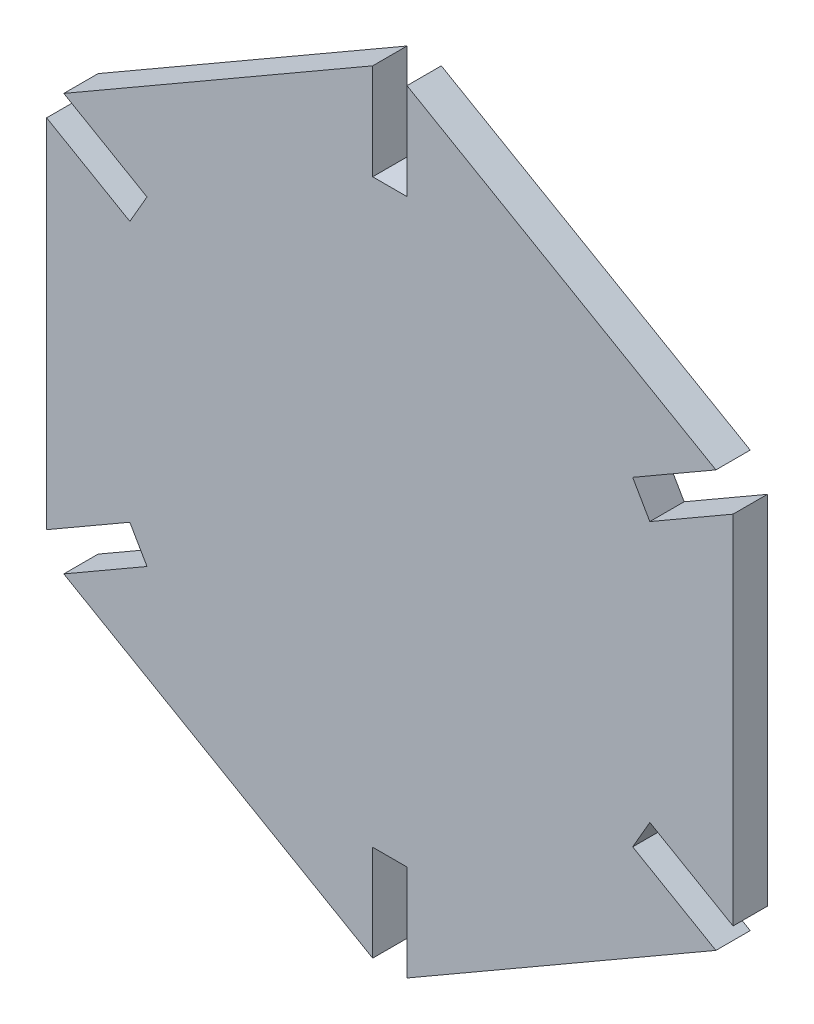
from build123d import *

# Parameters (mm, degrees)
BOSS_EXTRUDE1_DEPTH = 2.5
CUT_EXTRUDE1_DEPTH  = 2.5
CUT_EXTRUDE2_DEPTH  = 2.5


with BuildPart() as part:
    # Sketch2 → Boss-Extrude1 (new body)
    with BuildSketch(Plane.XY):
        Polygon((0, -28.867513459), (25, -14.43375673), (25, 14.43375673), (0, 28.867513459), (-25, 14.43375673), (-25, -14.43375673), align=None)
    extrude(amount=BOSS_EXTRUDE1_DEPTH)

    # Sketch8 → Cut-Extrude1 (cut)
    with BuildSketch(Plane.XY.offset(2.5)):
        Polygon((-1.25, 21.145825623), (1.25, 21.145825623), (1.25, 28.145825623), (0, 28.867513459), (-1.25, 28.145825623), align=None)
    extrude(amount=-CUT_EXTRUDE1_DEPTH, mode=Mode.SUBTRACT)

    # Sketch8_3 → Cut-Extrude2 (cut)
    with BuildSketch(Plane.XY.offset(2.5)):
        Polygon((-1.25, 21.145825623), (1.25, 21.145825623), (1.25, 28.145825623), (0, 28.867513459), (-1.25, 28.145825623), align=None)
        Polygon((23.75, 15.155444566), (25, 14.43375673), (25, 12.990381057), (18.937822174, 9.490381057), (17.687822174, 11.655444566), align=None)
        Polygon((25, -12.990381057), (25, -14.43375673), (23.75, -15.155444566), (17.687822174, -11.655444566), (18.937822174, -9.490381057), align=None)
        Polygon((1.25, -28.145825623), (0, -28.867513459), (-1.25, -28.145825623), (-1.25, -21.145825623), (1.25, -21.145825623), align=None)
        Polygon((-23.75, -15.155444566), (-25, -14.43375673), (-25, -12.990381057), (-18.937822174, -9.490381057), (-17.687822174, -11.655444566), align=None)
        Polygon((-25, 12.990381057), (-25, 14.43375673), (-23.75, 15.155444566), (-17.687822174, 11.655444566), (-18.937822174, 9.490381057), align=None)
    extrude(amount=-CUT_EXTRUDE2_DEPTH, mode=Mode.SUBTRACT)


solid = part.part
